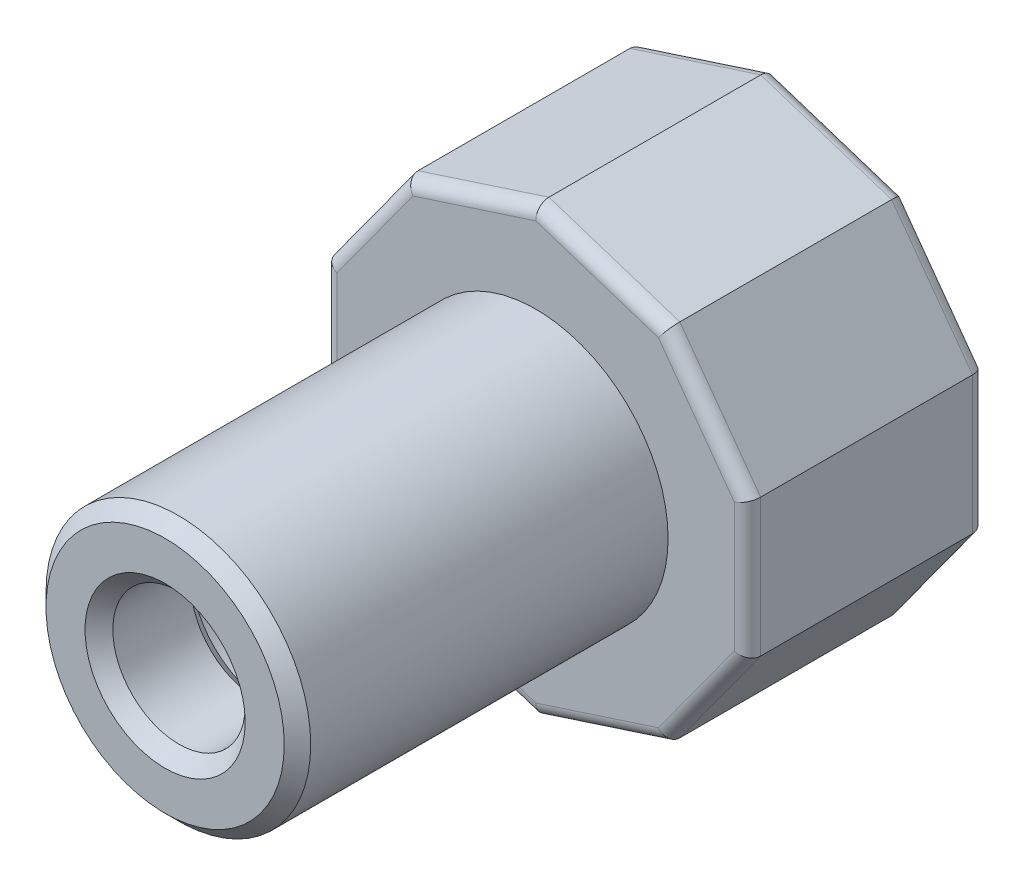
from build123d import *

# Parameters (mm, degrees)
BOSS_EXTRU_1_DEPTH      = 9
ESQUISSE2_R             = 5
BOSS_EXTRU_2_DEPTH      = 14
ESQUISSE3_R             = 3.375
ENL_V_MAT_EXTRU_1_DEPTH = 19
CHANFREIN1_SIZE         = 0.5
CONG_1_R                = 0.5


with BuildPart() as part:
    # Esquisse1 → Boss.-Extru.1 (new body)
    with BuildSketch(Plane.XY):
        Polygon((4.94427191, -6.805206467), (8, -2.59935757), (8, 2.59935757), (4.94427191, 6.805206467), (0, 8.411697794), (-4.94427191, 6.805206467), (-8, 2.59935757), (-8, -2.59935757), (-4.94427191, -6.805206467), (0, -8.411697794), align=None)
    extrude(amount=BOSS_EXTRU_1_DEPTH)

    # Esquisse2 → Boss.-Extru.2 (add)
    with BuildSketch(Plane.XY.offset(9)):
        Circle(ESQUISSE2_R)
    extrude(amount=BOSS_EXTRU_2_DEPTH)

    # Esquisse3 → Enl_v. mat.-Extru.1 (cut)
    with BuildSketch(Plane(origin=(0, 0, 0), x_dir=(-1, 0, 0), z_dir=(0, 0, -1))):
        Circle(ESQUISSE3_R)
    extrude(amount=-ENL_V_MAT_EXTRU_1_DEPTH, mode=Mode.SUBTRACT)

    # Esquisse5 → Trou taraud_ M61 (revolve, cut)
    with BuildSketch(Plane(origin=(0, 0, 23), x_dir=(0, -1, 0), z_dir=(1, 0, 0))):
        Polygon((0, 0), (0, 4), (3.025, 4), (2.5, 3.475), (2.5, 0.525), (3.025, 0), align=None)
    revolve(axis=Axis((0, 0, 29.35), (0, 0, -1)), mode=Mode.SUBTRACT)

    # Chanfrein1
    chanfrein1_edges = [part.edges().sort_by_distance(p)[0] for p in [
        (-5, 0, 23),
        (3.375, 0, 0),
    ]]
    chamfer(chanfrein1_edges, length=CHANFREIN1_SIZE)

    # Cong_1
    cong_1_edges = [part.edges().sort_by_distance(p)[0] for p in [
        (8, 0, 9),
        (-8, 0, 0),
        (-6.472135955, 4.702282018, 0),
        (-2.472135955, 7.60845213, 0),
        (2.472135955, 7.60845213, 0),
        (6.472135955, 4.702282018, 0),
        (8, 0, 0),
        (6.472135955, -4.702282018, 0),
        (2.472135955, -7.60845213, 0),
        (6.472135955, 4.702282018, 9),
        (2.472135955, 7.60845213, 9),
        (-2.472135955, 7.60845213, 9),
        (-6.472135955, 4.702282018, 9),
        (-8, 0, 9),
        (-6.472135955, -4.702282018, 9),
        (-2.472135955, -7.60845213, 9),
        (2.472135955, -7.60845213, 9),
        (6.472135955, -4.702282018, 9),
        (-2.472135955, -7.60845213, 0),
        (-6.472135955, -4.702282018, 0),
    ]]
    fillet(cong_1_edges, radius=CONG_1_R)


solid = part.part
